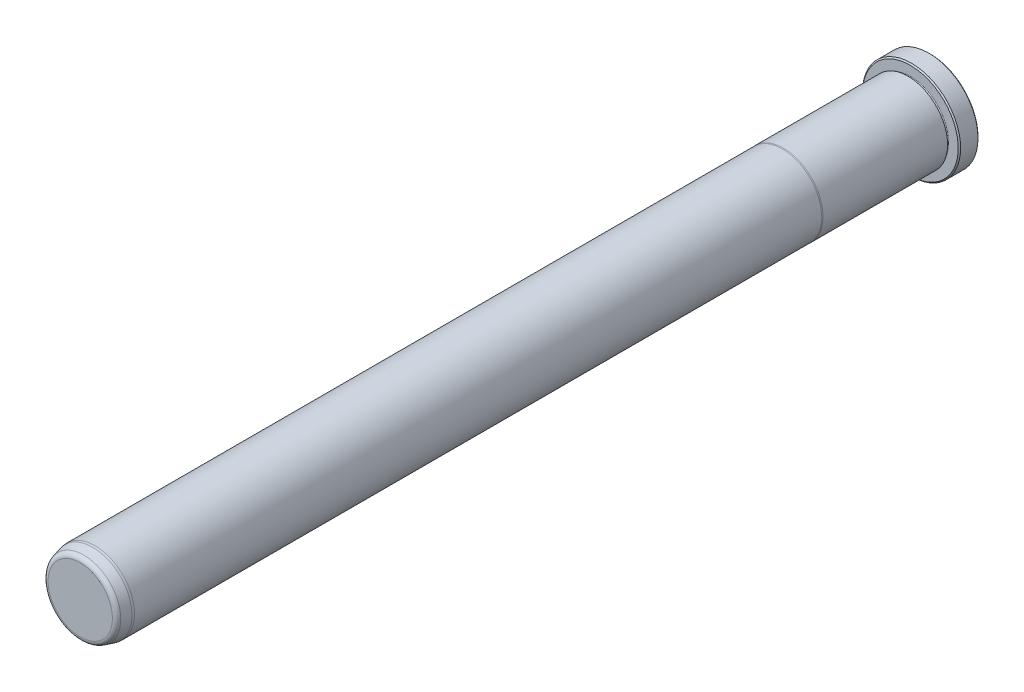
from build123d import *

# Parameters (mm, degrees)
FILLET6_R     = 1.5875
CHAMFER1_SIZE = 0.381


with BuildPart() as part:
    # Sketch1 → Revolve1 (revolve)
    with BuildSketch(Plane(origin=(0, 0, 0), x_dir=(0, 0, -1), z_dir=(1, 0, 0)), mode=Mode.PRIVATE) as revolve1_sk:
        with BuildLine():
            Line((0, 0), (0, 15.748))
            Line((0, 15.748), (-6.35, 15.748))
            Line((-6.35, 15.748), (-6.35, 12.3063))
            ThreePointArc((-6.35, 12.3063), (-6.731, 11.9253), (-7.112, 12.3063))
            Line((-7.112, 12.3063), (-7.112, 12.7127))
            Line((-7.112, 12.7127), (-47.134763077, 12.7127))
            Line((-47.134763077, 12.7127), (-47.498, 12.6873))
            Line((-47.498, 12.6873), (-268.2875, 12.6873))
            Line((-268.2875, 12.6873), (-269.0495, 12.620633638))
            Line((-269.0495, 12.620633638), (-273.05, 11.548702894))
            Line((-273.05, 11.548702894), (-273.05, 0))
            Line((-273.05, 0), (0, 0))
        make_face()
    revolve(revolve1_sk.sketch.rotate(Axis((0, 0, 0), (0, 0, -1)), 90), axis=Axis((0, 0, 0), (0, 0, -1)))

    # Fillet6
    fillet6_edges = [part.edges().sort_by_distance(p)[0] for p in [
        (-11.548702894, 0, 273.05),
    ]]
    fillet(fillet6_edges, radius=FILLET6_R)

    # Chamfer1
    chamfer1_edges = [part.edges().sort_by_distance(p)[0] for p in [
        (-15.748, 0, 6.35),
        (-15.748, 0, 0),
    ]]
    chamfer(chamfer1_edges, length=CHAMFER1_SIZE)


solid = part.part
